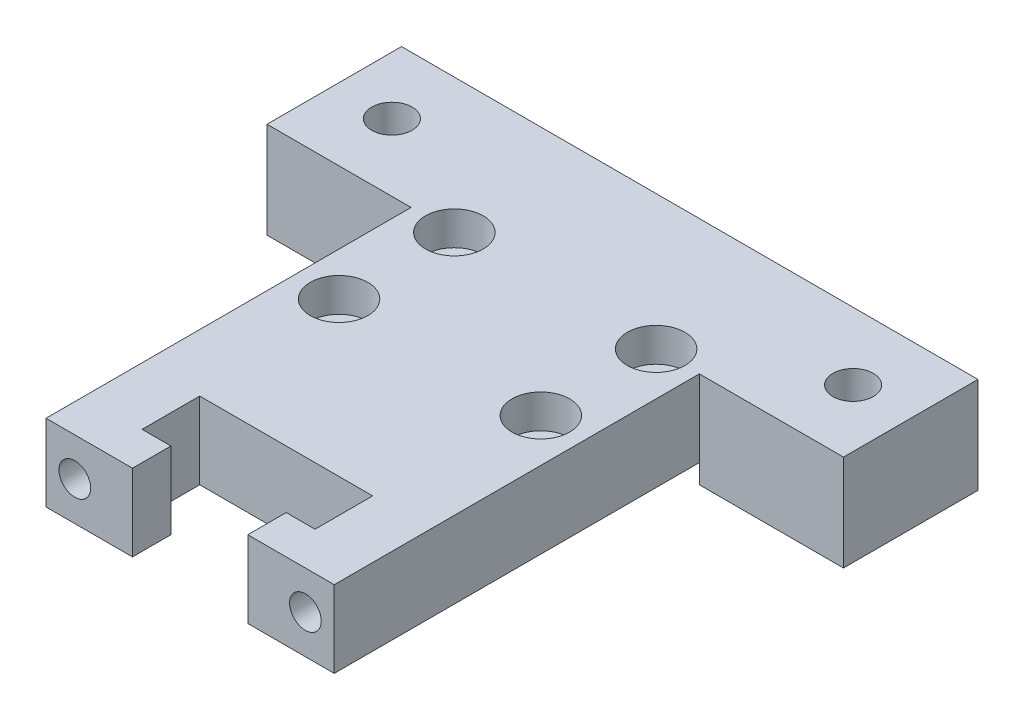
ISO-10303-21;
HEADER;
FILE_DESCRIPTION(('STEP AP214'),'2;1');
FILE_NAME('part.step','',(''),(''),'','','');
FILE_SCHEMA(('AUTOMOTIVE_DESIGN { 1 0 10303 214 1 1 1 1 }'));
ENDSEC;
DATA;
#1=APPLICATION_CONTEXT('core data for automotive mechanical design processes');
#2=APPLICATION_PROTOCOL_DEFINITION('international standard','automotive_design',2000,#1);
#3=PRODUCT_CONTEXT('',#1,'mechanical');
#4=PRODUCT('Part','Part','',(#3));
#5=PRODUCT_RELATED_PRODUCT_CATEGORY('part','',(#4));
#6=PRODUCT_DEFINITION_FORMATION('','',#4);
#7=PRODUCT_DEFINITION_CONTEXT('part definition',#1,'design');
#8=PRODUCT_DEFINITION('design','',#6,#7);
#9=PRODUCT_DEFINITION_SHAPE('','',#8);
#10=(LENGTH_UNIT() NAMED_UNIT(*) SI_UNIT(.MILLI.,.METRE.));
#11=(NAMED_UNIT(*) PLANE_ANGLE_UNIT() SI_UNIT($,.RADIAN.));
#12=(NAMED_UNIT(*) SI_UNIT($,.STERADIAN.) SOLID_ANGLE_UNIT());
#13=UNCERTAINTY_MEASURE_WITH_UNIT(LENGTH_MEASURE(1.E-05),#10,'distance_accuracy_value','');
#14=(GEOMETRIC_REPRESENTATION_CONTEXT(3) GLOBAL_UNCERTAINTY_ASSIGNED_CONTEXT((#13)) GLOBAL_UNIT_ASSIGNED_CONTEXT((#10,
#11,#12)) REPRESENTATION_CONTEXT('',''));
#15=CARTESIAN_POINT('',(0.,0.,0.));
#16=DIRECTION('',(0.,0.,1.));
#17=DIRECTION('',(1.,0.,0.));
#18=AXIS2_PLACEMENT_3D('',#15,#16,#17);
#19=CARTESIAN_POINT('',(12.,6.02822435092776,10.4999999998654));
#20=DIRECTION('',(0.,0.,1.));
#21=DIRECTION('',(1.,0.,0.));
#22=AXIS2_PLACEMENT_3D('',#19,#20,#21);
#23=CONICAL_SURFACE('',#22,1.64999999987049,1.02974425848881);
#24=CARTESIAN_POINT('',(11.9999999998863,6.02822435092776,9.50857997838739));
#25=VERTEX_POINT('',#24);
#26=VERTEX_LOOP('',#25);
#27=FACE_BOUND('',#26,.T.);
#28=CARTESIAN_POINT('',(12.,6.02822435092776,10.5));
#29=DIRECTION('',(0.,0.,1.));
#30=DIRECTION('',(1.,0.,0.));
#31=AXIS2_PLACEMENT_3D('',#28,#29,#30);
#32=CIRCLE('',#31,1.64999999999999);
#33=CARTESIAN_POINT('',(13.65,6.02822435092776,10.5));
#34=VERTEX_POINT('',#33);
#35=EDGE_CURVE('E156',#34,#34,#32,.T.);
#36=ORIENTED_EDGE('',*,*,#35,.T.);
#37=EDGE_LOOP('',(#36));
#38=FACE_BOUND('',#37,.T.);
#39=ADVANCED_FACE('F17',(#27,#38),#23,.F.);
#40=CARTESIAN_POINT('',(-12.,6.02822435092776,10.4999999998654));
#41=DIRECTION('',(0.,0.,1.));
#42=DIRECTION('',(1.,0.,0.));
#43=AXIS2_PLACEMENT_3D('',#40,#41,#42);
#44=CONICAL_SURFACE('',#43,1.64999999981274,1.02974425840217);
#45=CARTESIAN_POINT('',(-12.0000000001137,6.02822435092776,9.50857997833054));
#46=VERTEX_POINT('',#45);
#47=VERTEX_LOOP('',#46);
#48=FACE_BOUND('',#47,.T.);
#49=CARTESIAN_POINT('',(-12.,6.02822435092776,10.5));
#50=DIRECTION('',(0.,0.,1.));
#51=DIRECTION('',(1.,0.,0.));
#52=AXIS2_PLACEMENT_3D('',#49,#50,#51);
#53=CIRCLE('',#52,1.64999999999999);
#54=CARTESIAN_POINT('',(-10.35,6.02822435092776,10.5));
#55=VERTEX_POINT('',#54);
#56=EDGE_CURVE('E158',#55,#55,#53,.T.);
#57=ORIENTED_EDGE('',*,*,#56,.T.);
#58=EDGE_LOOP('',(#57));
#59=FACE_BOUND('',#58,.T.);
#60=ADVANCED_FACE('F153',(#48,#59),#44,.F.);
#61=CARTESIAN_POINT('',(-10.5,0.,0.));
#62=DIRECTION('',(0.,1.,0.));
#63=DIRECTION('',(0.,0.,1.));
#64=AXIS2_PLACEMENT_3D('',#61,#62,#63);
#65=CYLINDRICAL_SURFACE('',#64,1.75);
#66=CARTESIAN_POINT('',(-10.5,2.,0.));
#67=DIRECTION('',(0.,1.,0.));
#68=DIRECTION('',(0.,0.,1.));
#69=AXIS2_PLACEMENT_3D('',#66,#67,#68);
#70=CIRCLE('',#69,1.75);
#71=CARTESIAN_POINT('',(-10.5,2.,1.75));
#72=VERTEX_POINT('',#71);
#73=EDGE_CURVE('E20',#72,#72,#70,.T.);
#74=ORIENTED_EDGE('',*,*,#73,.F.);
#75=EDGE_LOOP('',(#74));
#76=FACE_BOUND('',#75,.T.);
#77=CARTESIAN_POINT('',(-10.5,6.5,0.));
#78=DIRECTION('',(0.,1.,0.));
#79=DIRECTION('',(0.,0.,1.));
#80=AXIS2_PLACEMENT_3D('',#77,#78,#79);
#81=CIRCLE('',#80,1.75);
#82=CARTESIAN_POINT('',(-10.5,6.5,1.75));
#83=VERTEX_POINT('',#82);
#84=EDGE_CURVE('E220',#83,#83,#81,.F.);
#85=ORIENTED_EDGE('',*,*,#84,.F.);
#86=EDGE_LOOP('',(#85));
#87=FACE_BOUND('',#86,.T.);
#88=ADVANCED_FACE('F536',(#76,#87),#65,.F.);
#89=CARTESIAN_POINT('',(10.5,0.,0.));
#90=DIRECTION('',(0.,1.,0.));
#91=DIRECTION('',(0.,0.,1.));
#92=AXIS2_PLACEMENT_3D('',#89,#90,#91);
#93=CYLINDRICAL_SURFACE('',#92,1.75);
#94=CARTESIAN_POINT('',(10.5,2.,0.));
#95=DIRECTION('',(0.,1.,0.));
#96=DIRECTION('',(0.,0.,1.));
#97=AXIS2_PLACEMENT_3D('',#94,#95,#96);
#98=CIRCLE('',#97,1.75);
#99=CARTESIAN_POINT('',(10.5,2.,1.75));
#100=VERTEX_POINT('',#99);
#101=EDGE_CURVE('E230',#100,#100,#98,.T.);
#102=ORIENTED_EDGE('',*,*,#101,.F.);
#103=EDGE_LOOP('',(#102));
#104=FACE_BOUND('',#103,.T.);
#105=CARTESIAN_POINT('',(10.5,6.5,0.));
#106=DIRECTION('',(0.,1.,0.));
#107=DIRECTION('',(0.,0.,1.));
#108=AXIS2_PLACEMENT_3D('',#105,#106,#107);
#109=CIRCLE('',#108,1.75);
#110=CARTESIAN_POINT('',(10.5,6.5,1.75));
#111=VERTEX_POINT('',#110);
#112=EDGE_CURVE('E217',#111,#111,#109,.F.);
#113=ORIENTED_EDGE('',*,*,#112,.F.);
#114=EDGE_LOOP('',(#113));
#115=FACE_BOUND('',#114,.T.);
#116=ADVANCED_FACE('F532',(#104,#115),#93,.F.);
#117=CARTESIAN_POINT('',(10.5,0.,-12.));
#118=DIRECTION('',(0.,1.,0.));
#119=DIRECTION('',(0.,0.,1.));
#120=AXIS2_PLACEMENT_3D('',#117,#118,#119);
#121=CYLINDRICAL_SURFACE('',#120,1.75);
#122=CARTESIAN_POINT('',(10.5,2.,-12.));
#123=DIRECTION('',(0.,1.,0.));
#124=DIRECTION('',(0.,0.,1.));
#125=AXIS2_PLACEMENT_3D('',#122,#123,#124);
#126=CIRCLE('',#125,1.75);
#127=CARTESIAN_POINT('',(10.5,2.,-10.25));
#128=VERTEX_POINT('',#127);
#129=EDGE_CURVE('E228',#128,#128,#126,.T.);
#130=ORIENTED_EDGE('',*,*,#129,.F.);
#131=EDGE_LOOP('',(#130));
#132=FACE_BOUND('',#131,.T.);
#133=CARTESIAN_POINT('',(10.5,6.5,-12.));
#134=DIRECTION('',(0.,1.,0.));
#135=DIRECTION('',(0.,0.,1.));
#136=AXIS2_PLACEMENT_3D('',#133,#134,#135);
#137=CIRCLE('',#136,1.75);
#138=CARTESIAN_POINT('',(10.5,6.5,-10.25));
#139=VERTEX_POINT('',#138);
#140=EDGE_CURVE('E214',#139,#139,#137,.F.);
#141=ORIENTED_EDGE('',*,*,#140,.F.);
#142=EDGE_LOOP('',(#141));
#143=FACE_BOUND('',#142,.T.);
#144=ADVANCED_FACE('F528',(#132,#143),#121,.F.);
#145=CARTESIAN_POINT('',(-10.5,0.,-12.));
#146=DIRECTION('',(0.,1.,0.));
#147=DIRECTION('',(0.,0.,1.));
#148=AXIS2_PLACEMENT_3D('',#145,#146,#147);
#149=CYLINDRICAL_SURFACE('',#148,1.75);
#150=CARTESIAN_POINT('',(-10.5,2.,-12.));
#151=DIRECTION('',(0.,1.,0.));
#152=DIRECTION('',(0.,0.,1.));
#153=AXIS2_PLACEMENT_3D('',#150,#151,#152);
#154=CIRCLE('',#153,1.75);
#155=CARTESIAN_POINT('',(-10.5,2.,-10.25));
#156=VERTEX_POINT('',#155);
#157=EDGE_CURVE('E224',#156,#156,#154,.T.);
#158=ORIENTED_EDGE('',*,*,#157,.F.);
#159=EDGE_LOOP('',(#158));
#160=FACE_BOUND('',#159,.T.);
#161=CARTESIAN_POINT('',(-10.5,6.5,-12.));
#162=DIRECTION('',(0.,1.,0.));
#163=DIRECTION('',(0.,0.,1.));
#164=AXIS2_PLACEMENT_3D('',#161,#162,#163);
#165=CIRCLE('',#164,1.75);
#166=CARTESIAN_POINT('',(-10.5,6.5,-10.25));
#167=VERTEX_POINT('',#166);
#168=EDGE_CURVE('E210',#167,#167,#165,.F.);
#169=ORIENTED_EDGE('',*,*,#168,.F.);
#170=EDGE_LOOP('',(#169));
#171=FACE_BOUND('',#170,.T.);
#172=ADVANCED_FACE('F525',(#160,#171),#149,.F.);
#173=CARTESIAN_POINT('',(12.,6.02822435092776,26.));
#174=DIRECTION('',(0.,0.,1.));
#175=DIRECTION('',(1.,0.,0.));
#176=AXIS2_PLACEMENT_3D('',#173,#174,#175);
#177=CYLINDRICAL_SURFACE('',#176,1.64999999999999);
#178=ORIENTED_EDGE('',*,*,#35,.F.);
#179=EDGE_LOOP('',(#178));
#180=FACE_BOUND('',#179,.T.);
#181=CARTESIAN_POINT('',(12.,6.02822435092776,26.));
#182=DIRECTION('',(0.,0.,1.));
#183=DIRECTION('',(1.,0.,0.));
#184=AXIS2_PLACEMENT_3D('',#181,#182,#183);
#185=CIRCLE('',#184,1.64999999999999);
#186=CARTESIAN_POINT('',(13.65,6.02822435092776,26.));
#187=VERTEX_POINT('',#186);
#188=EDGE_CURVE('E205',#187,#187,#185,.T.);
#189=ORIENTED_EDGE('',*,*,#188,.T.);
#190=EDGE_LOOP('',(#189));
#191=FACE_BOUND('',#190,.T.);
#192=ADVANCED_FACE('F521',(#180,#191),#177,.F.);
#193=CARTESIAN_POINT('',(15.,2.,26.));
#194=DIRECTION('',(1.,0.,0.));
#195=DIRECTION('',(0.,0.,-1.));
#196=AXIS2_PLACEMENT_3D('',#193,#194,#195);
#197=PLANE('',#196);
#198=DIRECTION('',(0.,1.,0.));
#199=VECTOR('',#198,1.);
#200=CARTESIAN_POINT('',(15.,10.,-12.));
#201=LINE('',#200,#199);
#202=CARTESIAN_POINT('',(15.,0.,-12.));
#203=VERTEX_POINT('',#202);
#204=CARTESIAN_POINT('',(15.,2.,-12.));
#205=VERTEX_POINT('',#204);
#206=EDGE_CURVE('E258',#203,#205,#201,.T.);
#207=ORIENTED_EDGE('',*,*,#206,.T.);
#208=DIRECTION('',(0.,0.,-1.));
#209=VECTOR('',#208,1.);
#210=CARTESIAN_POINT('',(15.,2.,0.));
#211=LINE('',#210,#209);
#212=CARTESIAN_POINT('',(15.,2.,-26.));
#213=VERTEX_POINT('',#212);
#214=EDGE_CURVE('E235',#213,#205,#211,.F.);
#215=ORIENTED_EDGE('',*,*,#214,.F.);
#216=DIRECTION('',(0.,1.,0.));
#217=VECTOR('',#216,1.);
#218=CARTESIAN_POINT('',(15.,10.,-26.));
#219=LINE('',#218,#217);
#220=CARTESIAN_POINT('',(15.,0.,-26.));
#221=VERTEX_POINT('',#220);
#222=EDGE_CURVE('E278',#213,#221,#219,.F.);
#223=ORIENTED_EDGE('',*,*,#222,.T.);
#224=DIRECTION('',(0.,0.,1.));
#225=VECTOR('',#224,1.);
#226=CARTESIAN_POINT('',(15.,0.,0.));
#227=LINE('',#226,#225);
#228=EDGE_CURVE('E223',#221,#203,#227,.T.);
#229=ORIENTED_EDGE('',*,*,#228,.T.);
#230=EDGE_LOOP('',(#207,#215,#223,#229));
#231=FACE_BOUND('',#230,.T.);
#232=ADVANCED_FACE('F517',(#231),#197,.F.);
#233=CARTESIAN_POINT('',(-15.,2.,26.));
#234=DIRECTION('',(-1.,0.,0.));
#235=DIRECTION('',(0.,0.,1.));
#236=AXIS2_PLACEMENT_3D('',#233,#234,#235);
#237=PLANE('',#236);
#238=DIRECTION('',(0.,1.,0.));
#239=VECTOR('',#238,1.);
#240=CARTESIAN_POINT('',(-15.,10.,-12.));
#241=LINE('',#240,#239);
#242=CARTESIAN_POINT('',(-15.,2.,-12.));
#243=VERTEX_POINT('',#242);
#244=CARTESIAN_POINT('',(-15.,0.,-12.));
#245=VERTEX_POINT('',#244);
#246=EDGE_CURVE('E290',#243,#245,#241,.F.);
#247=ORIENTED_EDGE('',*,*,#246,.T.);
#248=DIRECTION('',(0.,0.,1.));
#249=VECTOR('',#248,1.);
#250=CARTESIAN_POINT('',(-15.,0.,0.));
#251=LINE('',#250,#249);
#252=CARTESIAN_POINT('',(-15.,0.,-26.));
#253=VERTEX_POINT('',#252);
#254=EDGE_CURVE('E227',#245,#253,#251,.F.);
#255=ORIENTED_EDGE('',*,*,#254,.T.);
#256=DIRECTION('',(0.,1.,0.));
#257=VECTOR('',#256,1.);
#258=CARTESIAN_POINT('',(-15.,10.,-26.));
#259=LINE('',#258,#257);
#260=CARTESIAN_POINT('',(-15.,2.,-26.));
#261=VERTEX_POINT('',#260);
#262=EDGE_CURVE('E274',#253,#261,#259,.T.);
#263=ORIENTED_EDGE('',*,*,#262,.T.);
#264=DIRECTION('',(0.,0.,-1.));
#265=VECTOR('',#264,1.);
#266=CARTESIAN_POINT('',(-15.,2.,0.));
#267=LINE('',#266,#265);
#268=EDGE_CURVE('E161',#243,#261,#267,.T.);
#269=ORIENTED_EDGE('',*,*,#268,.F.);
#270=EDGE_LOOP('',(#247,#255,#263,#269));
#271=FACE_BOUND('',#270,.T.);
#272=ADVANCED_FACE('F513',(#271),#237,.F.);
#273=CARTESIAN_POINT('',(-12.,6.02822435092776,26.));
#274=DIRECTION('',(0.,0.,1.));
#275=DIRECTION('',(1.,0.,0.));
#276=AXIS2_PLACEMENT_3D('',#273,#274,#275);
#277=CYLINDRICAL_SURFACE('',#276,1.64999999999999);
#278=ORIENTED_EDGE('',*,*,#56,.F.);
#279=EDGE_LOOP('',(#278));
#280=FACE_BOUND('',#279,.T.);
#281=CARTESIAN_POINT('',(-12.,6.02822435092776,26.));
#282=DIRECTION('',(0.,0.,1.));
#283=DIRECTION('',(1.,0.,0.));
#284=AXIS2_PLACEMENT_3D('',#281,#282,#283);
#285=CIRCLE('',#284,1.64999999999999);
#286=CARTESIAN_POINT('',(-10.35,6.02822435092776,26.));
#287=VERTEX_POINT('',#286);
#288=EDGE_CURVE('E200',#287,#287,#285,.T.);
#289=ORIENTED_EDGE('',*,*,#288,.T.);
#290=EDGE_LOOP('',(#289));
#291=FACE_BOUND('',#290,.T.);
#292=ADVANCED_FACE('F506',(#280,#291),#277,.F.);
#293=CARTESIAN_POINT('',(0.,2.,0.));
#294=DIRECTION('',(0.,-1.,0.));
#295=DIRECTION('',(0.,0.,-1.));
#296=AXIS2_PLACEMENT_3D('',#293,#294,#295);
#297=PLANE('',#296);
#298=ORIENTED_EDGE('',*,*,#157,.T.);
#299=EDGE_LOOP('',(#298));
#300=FACE_BOUND('',#299,.T.);
#301=ORIENTED_EDGE('',*,*,#129,.T.);
#302=EDGE_LOOP('',(#301));
#303=FACE_BOUND('',#302,.T.);
#304=ORIENTED_EDGE('',*,*,#101,.T.);
#305=EDGE_LOOP('',(#304));
#306=FACE_BOUND('',#305,.T.);
#307=ORIENTED_EDGE('',*,*,#73,.T.);
#308=EDGE_LOOP('',(#307));
#309=FACE_BOUND('',#308,.T.);
#310=DIRECTION('',(-1.,0.,0.));
#311=VECTOR('',#310,1.);
#312=CARTESIAN_POINT('',(-6.00000000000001,2.,16.));
#313=LINE('',#312,#311);
#314=CARTESIAN_POINT('',(8.99999999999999,2.,16.));
#315=VERTEX_POINT('',#314);
#316=CARTESIAN_POINT('',(-9.00000000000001,2.,16.));
#317=VERTEX_POINT('',#316);
#318=EDGE_CURVE('E320',#315,#317,#313,.T.);
#319=ORIENTED_EDGE('',*,*,#318,.T.);
#320=DIRECTION('',(0.,0.,1.));
#321=VECTOR('',#320,1.);
#322=CARTESIAN_POINT('',(-9.00000000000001,2.,16.));
#323=LINE('',#322,#321);
#324=CARTESIAN_POINT('',(-9.00000000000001,2.,22.));
#325=VERTEX_POINT('',#324);
#326=EDGE_CURVE('E315',#317,#325,#323,.T.);
#327=ORIENTED_EDGE('',*,*,#326,.T.);
#328=DIRECTION('',(1.,0.,0.));
#329=VECTOR('',#328,1.);
#330=CARTESIAN_POINT('',(-9.00000000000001,2.,22.));
#331=LINE('',#330,#329);
#332=CARTESIAN_POINT('',(-6.00000000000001,2.,22.));
#333=VERTEX_POINT('',#332);
#334=EDGE_CURVE('E310',#325,#333,#331,.T.);
#335=ORIENTED_EDGE('',*,*,#334,.T.);
#336=DIRECTION('',(0.,0.,1.));
#337=VECTOR('',#336,1.);
#338=CARTESIAN_POINT('',(-6.00000000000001,2.,36.));
#339=LINE('',#338,#337);
#340=CARTESIAN_POINT('',(-6.00000000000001,2.,26.));
#341=VERTEX_POINT('',#340);
#342=EDGE_CURVE('E305',#333,#341,#339,.T.);
#343=ORIENTED_EDGE('',*,*,#342,.T.);
#344=DIRECTION('',(-1.,0.,0.));
#345=VECTOR('',#344,1.);
#346=CARTESIAN_POINT('',(-30.,2.,26.));
#347=LINE('',#346,#345);
#348=CARTESIAN_POINT('',(-15.,2.,26.));
#349=VERTEX_POINT('',#348);
#350=EDGE_CURVE('E300',#341,#349,#347,.T.);
#351=ORIENTED_EDGE('',*,*,#350,.T.);
#352=DIRECTION('',(0.,0.,-1.));
#353=VECTOR('',#352,1.);
#354=CARTESIAN_POINT('',(-15.,2.,26.));
#355=LINE('',#354,#353);
#356=EDGE_CURVE('E204',#349,#243,#355,.T.);
#357=ORIENTED_EDGE('',*,*,#356,.T.);
#358=ORIENTED_EDGE('',*,*,#268,.T.);
#359=DIRECTION('',(1.,0.,0.));
#360=VECTOR('',#359,1.);
#361=CARTESIAN_POINT('',(-30.,2.,-26.));
#362=LINE('',#361,#360);
#363=EDGE_CURVE('E276',#261,#213,#362,.T.);
#364=ORIENTED_EDGE('',*,*,#363,.T.);
#365=ORIENTED_EDGE('',*,*,#214,.T.);
#366=DIRECTION('',(0.,0.,1.));
#367=VECTOR('',#366,1.);
#368=CARTESIAN_POINT('',(15.,2.,26.));
#369=LINE('',#368,#367);
#370=CARTESIAN_POINT('',(15.,2.,26.));
#371=VERTEX_POINT('',#370);
#372=EDGE_CURVE('E256',#205,#371,#369,.T.);
#373=ORIENTED_EDGE('',*,*,#372,.T.);
#374=DIRECTION('',(-1.,0.,0.));
#375=VECTOR('',#374,1.);
#376=CARTESIAN_POINT('',(-30.,2.,26.));
#377=LINE('',#376,#375);
#378=CARTESIAN_POINT('',(5.99999999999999,2.,26.));
#379=VERTEX_POINT('',#378);
#380=EDGE_CURVE('E208',#371,#379,#377,.T.);
#381=ORIENTED_EDGE('',*,*,#380,.T.);
#382=DIRECTION('',(0.,0.,-1.));
#383=VECTOR('',#382,1.);
#384=CARTESIAN_POINT('',(5.99999999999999,2.,36.));
#385=LINE('',#384,#383);
#386=CARTESIAN_POINT('',(5.99999999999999,2.,22.));
#387=VERTEX_POINT('',#386);
#388=EDGE_CURVE('E248',#379,#387,#385,.T.);
#389=ORIENTED_EDGE('',*,*,#388,.T.);
#390=DIRECTION('',(1.,0.,0.));
#391=VECTOR('',#390,1.);
#392=CARTESIAN_POINT('',(-9.00000000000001,2.,22.));
#393=LINE('',#392,#391);
#394=CARTESIAN_POINT('',(8.99999999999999,2.,22.));
#395=VERTEX_POINT('',#394);
#396=EDGE_CURVE('E213',#387,#395,#393,.T.);
#397=ORIENTED_EDGE('',*,*,#396,.T.);
#398=DIRECTION('',(0.,0.,-1.));
#399=VECTOR('',#398,1.);
#400=CARTESIAN_POINT('',(8.99999999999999,2.,22.));
#401=LINE('',#400,#399);
#402=EDGE_CURVE('E199',#395,#315,#401,.T.);
#403=ORIENTED_EDGE('',*,*,#402,.T.);
#404=EDGE_LOOP('',(#319,#327,#335,#343,#351,#357,#358,#364,#365,#373,#381,#389,#397,#403));
#405=FACE_BOUND('',#404,.T.);
#406=ADVANCED_FACE('F496',(#300,#303,#306,#309,#405),#297,.T.);
#407=CARTESIAN_POINT('',(0.,0.,0.));
#408=DIRECTION('',(0.,1.,0.));
#409=DIRECTION('',(0.,0.,1.));
#410=AXIS2_PLACEMENT_3D('',#407,#408,#409);
#411=PLANE('',#410);
#412=DIRECTION('',(-1.,0.,0.));
#413=VECTOR('',#412,1.);
#414=CARTESIAN_POINT('',(-30.,0.,-12.));
#415=LINE('',#414,#413);
#416=CARTESIAN_POINT('',(-30.,0.,-12.));
#417=VERTEX_POINT('',#416);
#418=EDGE_CURVE('E292',#245,#417,#415,.T.);
#419=ORIENTED_EDGE('',*,*,#418,.T.);
#420=DIRECTION('',(0.,0.,-1.));
#421=VECTOR('',#420,1.);
#422=CARTESIAN_POINT('',(-30.,0.,-26.));
#423=LINE('',#422,#421);
#424=CARTESIAN_POINT('',(-30.,0.,-26.));
#425=VERTEX_POINT('',#424);
#426=EDGE_CURVE('E285',#417,#425,#423,.T.);
#427=ORIENTED_EDGE('',*,*,#426,.T.);
#428=DIRECTION('',(1.,0.,0.));
#429=VECTOR('',#428,1.);
#430=CARTESIAN_POINT('',(-30.,0.,-26.));
#431=LINE('',#430,#429);
#432=EDGE_CURVE('E271',#425,#253,#431,.T.);
#433=ORIENTED_EDGE('',*,*,#432,.T.);
#434=ORIENTED_EDGE('',*,*,#254,.F.);
#435=EDGE_LOOP('',(#419,#427,#433,#434));
#436=FACE_BOUND('',#435,.T.);
#437=CARTESIAN_POINT('',(-24.,0.,-19.));
#438=DIRECTION('',(0.,1.,0.));
#439=DIRECTION('',(0.,0.,1.));
#440=AXIS2_PLACEMENT_3D('',#437,#438,#439);
#441=CIRCLE('',#440,2.09999999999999);
#442=CARTESIAN_POINT('',(-24.,0.,-16.9));
#443=VERTEX_POINT('',#442);
#444=EDGE_CURVE('E196',#443,#443,#441,.T.);
#445=ORIENTED_EDGE('',*,*,#444,.T.);
#446=EDGE_LOOP('',(#445));
#447=FACE_BOUND('',#446,.T.);
#448=ADVANCED_FACE('F493',(#436,#447),#411,.F.);
#449=CARTESIAN_POINT('',(0.,0.,0.));
#450=DIRECTION('',(0.,1.,0.));
#451=DIRECTION('',(0.,0.,1.));
#452=AXIS2_PLACEMENT_3D('',#449,#450,#451);
#453=PLANE('',#452);
#454=DIRECTION('',(-1.,0.,0.));
#455=VECTOR('',#454,1.);
#456=CARTESIAN_POINT('',(30.,0.,-12.));
#457=LINE('',#456,#455);
#458=CARTESIAN_POINT('',(30.,0.,-12.));
#459=VERTEX_POINT('',#458);
#460=EDGE_CURVE('E262',#459,#203,#457,.T.);
#461=ORIENTED_EDGE('',*,*,#460,.T.);
#462=ORIENTED_EDGE('',*,*,#228,.F.);
#463=DIRECTION('',(1.,0.,0.));
#464=VECTOR('',#463,1.);
#465=CARTESIAN_POINT('',(-30.,0.,-26.));
#466=LINE('',#465,#464);
#467=CARTESIAN_POINT('',(30.,0.,-26.));
#468=VERTEX_POINT('',#467);
#469=EDGE_CURVE('E280',#221,#468,#466,.T.);
#470=ORIENTED_EDGE('',*,*,#469,.T.);
#471=DIRECTION('',(0.,0.,1.));
#472=VECTOR('',#471,1.);
#473=CARTESIAN_POINT('',(30.,0.,-26.));
#474=LINE('',#473,#472);
#475=EDGE_CURVE('E265',#468,#459,#474,.T.);
#476=ORIENTED_EDGE('',*,*,#475,.T.);
#477=EDGE_LOOP('',(#461,#462,#470,#476));
#478=FACE_BOUND('',#477,.T.);
#479=CARTESIAN_POINT('',(24.,0.,-19.));
#480=DIRECTION('',(0.,1.,0.));
#481=DIRECTION('',(0.,0.,1.));
#482=AXIS2_PLACEMENT_3D('',#479,#480,#481);
#483=CIRCLE('',#482,2.09999999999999);
#484=CARTESIAN_POINT('',(24.,0.,-16.9));
#485=VERTEX_POINT('',#484);
#486=EDGE_CURVE('E193',#485,#485,#483,.T.);
#487=ORIENTED_EDGE('',*,*,#486,.T.);
#488=EDGE_LOOP('',(#487));
#489=FACE_BOUND('',#488,.T.);
#490=ADVANCED_FACE('F495',(#478,#489),#453,.F.);
#491=CARTESIAN_POINT('',(-10.5,6.5,0.));
#492=DIRECTION('',(0.,1.,0.));
#493=DIRECTION('',(0.,0.,1.));
#494=AXIS2_PLACEMENT_3D('',#491,#492,#493);
#495=PLANE('',#494);
#496=ORIENTED_EDGE('',*,*,#84,.T.);
#497=EDGE_LOOP('',(#496));
#498=FACE_BOUND('',#497,.T.);
#499=CARTESIAN_POINT('',(-10.5,6.5,0.));
#500=DIRECTION('',(0.,1.,0.));
#501=DIRECTION('',(0.,0.,1.));
#502=AXIS2_PLACEMENT_3D('',#499,#500,#501);
#503=CIRCLE('',#502,3.);
#504=CARTESIAN_POINT('',(-10.5,6.5,3.));
#505=VERTEX_POINT('',#504);
#506=EDGE_CURVE('E190',#505,#505,#503,.T.);
#507=ORIENTED_EDGE('',*,*,#506,.T.);
#508=EDGE_LOOP('',(#507));
#509=FACE_BOUND('',#508,.T.);
#510=ADVANCED_FACE('F503',(#498,#509),#495,.T.);
#511=CARTESIAN_POINT('',(10.5,6.5,0.));
#512=DIRECTION('',(0.,1.,0.));
#513=DIRECTION('',(0.,0.,1.));
#514=AXIS2_PLACEMENT_3D('',#511,#512,#513);
#515=PLANE('',#514);
#516=ORIENTED_EDGE('',*,*,#112,.T.);
#517=EDGE_LOOP('',(#516));
#518=FACE_BOUND('',#517,.T.);
#519=CARTESIAN_POINT('',(10.5,6.5,0.));
#520=DIRECTION('',(0.,1.,0.));
#521=DIRECTION('',(0.,0.,1.));
#522=AXIS2_PLACEMENT_3D('',#519,#520,#521);
#523=CIRCLE('',#522,3.);
#524=CARTESIAN_POINT('',(10.5,6.5,3.));
#525=VERTEX_POINT('',#524);
#526=EDGE_CURVE('E187',#525,#525,#523,.T.);
#527=ORIENTED_EDGE('',*,*,#526,.T.);
#528=EDGE_LOOP('',(#527));
#529=FACE_BOUND('',#528,.T.);
#530=ADVANCED_FACE('F582',(#518,#529),#515,.T.);
#531=CARTESIAN_POINT('',(10.5,6.5,-12.));
#532=DIRECTION('',(0.,1.,0.));
#533=DIRECTION('',(0.,0.,1.));
#534=AXIS2_PLACEMENT_3D('',#531,#532,#533);
#535=PLANE('',#534);
#536=ORIENTED_EDGE('',*,*,#140,.T.);
#537=EDGE_LOOP('',(#536));
#538=FACE_BOUND('',#537,.T.);
#539=CARTESIAN_POINT('',(10.5,6.5,-12.));
#540=DIRECTION('',(0.,1.,0.));
#541=DIRECTION('',(0.,0.,1.));
#542=AXIS2_PLACEMENT_3D('',#539,#540,#541);
#543=CIRCLE('',#542,3.);
#544=CARTESIAN_POINT('',(10.5,6.5,-9.));
#545=VERTEX_POINT('',#544);
#546=EDGE_CURVE('E184',#545,#545,#543,.T.);
#547=ORIENTED_EDGE('',*,*,#546,.T.);
#548=EDGE_LOOP('',(#547));
#549=FACE_BOUND('',#548,.T.);
#550=ADVANCED_FACE('F578',(#538,#549),#535,.T.);
#551=CARTESIAN_POINT('',(-10.5,6.5,-12.));
#552=DIRECTION('',(0.,1.,0.));
#553=DIRECTION('',(0.,0.,1.));
#554=AXIS2_PLACEMENT_3D('',#551,#552,#553);
#555=PLANE('',#554);
#556=ORIENTED_EDGE('',*,*,#168,.T.);
#557=EDGE_LOOP('',(#556));
#558=FACE_BOUND('',#557,.T.);
#559=CARTESIAN_POINT('',(-10.5,6.5,-12.));
#560=DIRECTION('',(0.,1.,0.));
#561=DIRECTION('',(0.,0.,1.));
#562=AXIS2_PLACEMENT_3D('',#559,#560,#561);
#563=CIRCLE('',#562,3.);
#564=CARTESIAN_POINT('',(-10.5,6.5,-9.));
#565=VERTEX_POINT('',#564);
#566=EDGE_CURVE('E180',#565,#565,#563,.T.);
#567=ORIENTED_EDGE('',*,*,#566,.T.);
#568=EDGE_LOOP('',(#567));
#569=FACE_BOUND('',#568,.T.);
#570=ADVANCED_FACE('F575',(#558,#569),#555,.T.);
#571=CARTESIAN_POINT('',(-9.00000000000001,0.,22.));
#572=DIRECTION('',(0.,0.,1.));
#573=DIRECTION('',(1.,0.,0.));
#574=AXIS2_PLACEMENT_3D('',#571,#572,#573);
#575=PLANE('',#574);
#576=DIRECTION('',(0.,1.,0.));
#577=VECTOR('',#576,1.);
#578=CARTESIAN_POINT('',(5.99999999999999,0.,22.));
#579=LINE('',#578,#577);
#580=CARTESIAN_POINT('',(5.99999999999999,10.,22.));
#581=VERTEX_POINT('',#580);
#582=EDGE_CURVE('E209',#387,#581,#579,.T.);
#583=ORIENTED_EDGE('',*,*,#582,.T.);
#584=DIRECTION('',(1.,0.,0.));
#585=VECTOR('',#584,1.);
#586=CARTESIAN_POINT('',(0.,10.,22.));
#587=LINE('',#586,#585);
#588=CARTESIAN_POINT('',(8.99999999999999,10.,22.));
#589=VERTEX_POINT('',#588);
#590=EDGE_CURVE('E183',#589,#581,#587,.F.);
#591=ORIENTED_EDGE('',*,*,#590,.F.);
#592=DIRECTION('',(0.,1.,0.));
#593=VECTOR('',#592,1.);
#594=CARTESIAN_POINT('',(8.99999999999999,0.,22.));
#595=LINE('',#594,#593);
#596=EDGE_CURVE('E324',#589,#395,#595,.F.);
#597=ORIENTED_EDGE('',*,*,#596,.T.);
#598=ORIENTED_EDGE('',*,*,#396,.F.);
#599=EDGE_LOOP('',(#583,#591,#597,#598));
#600=FACE_BOUND('',#599,.T.);
#601=ADVANCED_FACE('F382',(#600),#575,.F.);
#602=CARTESIAN_POINT('',(5.99999999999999,0.,36.));
#603=DIRECTION('',(1.,0.,0.));
#604=DIRECTION('',(0.,0.,-1.));
#605=AXIS2_PLACEMENT_3D('',#602,#603,#604);
#606=PLANE('',#605);
#607=ORIENTED_EDGE('',*,*,#582,.F.);
#608=ORIENTED_EDGE('',*,*,#388,.F.);
#609=DIRECTION('',(0.,1.,0.));
#610=VECTOR('',#609,1.);
#611=CARTESIAN_POINT('',(5.99999999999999,10.,26.));
#612=LINE('',#611,#610);
#613=CARTESIAN_POINT('',(5.99999999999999,10.,26.));
#614=VERTEX_POINT('',#613);
#615=EDGE_CURVE('E252',#379,#614,#612,.T.);
#616=ORIENTED_EDGE('',*,*,#615,.T.);
#617=DIRECTION('',(0.,0.,1.));
#618=VECTOR('',#617,1.);
#619=CARTESIAN_POINT('',(5.99999999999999,10.,0.));
#620=LINE('',#619,#618);
#621=EDGE_CURVE('E331',#581,#614,#620,.T.);
#622=ORIENTED_EDGE('',*,*,#621,.F.);
#623=EDGE_LOOP('',(#607,#608,#616,#622));
#624=FACE_BOUND('',#623,.T.);
#625=ADVANCED_FACE('F387',(#624),#606,.F.);
#626=CARTESIAN_POINT('',(-30.,10.,26.));
#627=DIRECTION('',(0.,0.,-1.));
#628=DIRECTION('',(-1.,0.,0.));
#629=AXIS2_PLACEMENT_3D('',#626,#627,#628);
#630=PLANE('',#629);
#631=ORIENTED_EDGE('',*,*,#615,.F.);
#632=ORIENTED_EDGE('',*,*,#380,.F.);
#633=DIRECTION('',(0.,1.,0.));
#634=VECTOR('',#633,1.);
#635=CARTESIAN_POINT('',(15.,10.,26.));
#636=LINE('',#635,#634);
#637=CARTESIAN_POINT('',(15.,10.,26.));
#638=VERTEX_POINT('',#637);
#639=EDGE_CURVE('E254',#371,#638,#636,.T.);
#640=ORIENTED_EDGE('',*,*,#639,.T.);
#641=DIRECTION('',(1.,0.,0.));
#642=VECTOR('',#641,1.);
#643=CARTESIAN_POINT('',(0.,10.,26.));
#644=LINE('',#643,#642);
#645=EDGE_CURVE('E334',#614,#638,#644,.T.);
#646=ORIENTED_EDGE('',*,*,#645,.F.);
#647=EDGE_LOOP('',(#631,#632,#640,#646));
#648=FACE_BOUND('',#647,.T.);
#649=ORIENTED_EDGE('',*,*,#188,.F.);
#650=EDGE_LOOP('',(#649));
#651=FACE_BOUND('',#650,.T.);
#652=ADVANCED_FACE('F392',(#648,#651),#630,.F.);
#653=CARTESIAN_POINT('',(15.,10.,26.));
#654=DIRECTION('',(-1.,0.,0.));
#655=DIRECTION('',(0.,0.,1.));
#656=AXIS2_PLACEMENT_3D('',#653,#654,#655);
#657=PLANE('',#656);
#658=DIRECTION('',(0.,1.,0.));
#659=VECTOR('',#658,1.);
#660=CARTESIAN_POINT('',(15.,10.,-12.));
#661=LINE('',#660,#659);
#662=CARTESIAN_POINT('',(15.,10.,-12.));
#663=VERTEX_POINT('',#662);
#664=EDGE_CURVE('E260',#205,#663,#661,.T.);
#665=ORIENTED_EDGE('',*,*,#664,.T.);
#666=DIRECTION('',(0.,0.,1.));
#667=VECTOR('',#666,1.);
#668=CARTESIAN_POINT('',(15.,10.,0.));
#669=LINE('',#668,#667);
#670=EDGE_CURVE('E337',#638,#663,#669,.F.);
#671=ORIENTED_EDGE('',*,*,#670,.F.);
#672=ORIENTED_EDGE('',*,*,#639,.F.);
#673=ORIENTED_EDGE('',*,*,#372,.F.);
#674=EDGE_LOOP('',(#665,#671,#672,#673));
#675=FACE_BOUND('',#674,.T.);
#676=ADVANCED_FACE('F397',(#675),#657,.F.);
#677=CARTESIAN_POINT('',(30.,10.,-12.));
#678=DIRECTION('',(0.,0.,-1.));
#679=DIRECTION('',(-1.,0.,0.));
#680=AXIS2_PLACEMENT_3D('',#677,#678,#679);
#681=PLANE('',#680);
#682=DIRECTION('',(0.,1.,0.));
#683=VECTOR('',#682,1.);
#684=CARTESIAN_POINT('',(30.,10.,-12.));
#685=LINE('',#684,#683);
#686=CARTESIAN_POINT('',(30.,10.,-12.));
#687=VERTEX_POINT('',#686);
#688=EDGE_CURVE('E267',#459,#687,#685,.T.);
#689=ORIENTED_EDGE('',*,*,#688,.T.);
#690=DIRECTION('',(1.,0.,0.));
#691=VECTOR('',#690,1.);
#692=CARTESIAN_POINT('',(0.,10.,-12.));
#693=LINE('',#692,#691);
#694=EDGE_CURVE('E340',#663,#687,#693,.T.);
#695=ORIENTED_EDGE('',*,*,#694,.F.);
#696=ORIENTED_EDGE('',*,*,#664,.F.);
#697=ORIENTED_EDGE('',*,*,#206,.F.);
#698=ORIENTED_EDGE('',*,*,#460,.F.);
#699=EDGE_LOOP('',(#689,#695,#696,#697,#698));
#700=FACE_BOUND('',#699,.T.);
#701=ADVANCED_FACE('F402',(#700),#681,.F.);
#702=CARTESIAN_POINT('',(30.,10.,-26.));
#703=DIRECTION('',(-1.,0.,0.));
#704=DIRECTION('',(0.,0.,1.));
#705=AXIS2_PLACEMENT_3D('',#702,#703,#704);
#706=PLANE('',#705);
#707=ORIENTED_EDGE('',*,*,#688,.F.);
#708=ORIENTED_EDGE('',*,*,#475,.F.);
#709=DIRECTION('',(0.,1.,0.));
#710=VECTOR('',#709,1.);
#711=CARTESIAN_POINT('',(30.,10.,-26.));
#712=LINE('',#711,#710);
#713=CARTESIAN_POINT('',(30.,10.,-26.));
#714=VERTEX_POINT('',#713);
#715=EDGE_CURVE('E269',#468,#714,#712,.T.);
#716=ORIENTED_EDGE('',*,*,#715,.T.);
#717=DIRECTION('',(0.,0.,1.));
#718=VECTOR('',#717,1.);
#719=CARTESIAN_POINT('',(30.,10.,0.));
#720=LINE('',#719,#718);
#721=EDGE_CURVE('E343',#687,#714,#720,.F.);
#722=ORIENTED_EDGE('',*,*,#721,.F.);
#723=EDGE_LOOP('',(#707,#708,#716,#722));
#724=FACE_BOUND('',#723,.T.);
#725=ADVANCED_FACE('F408',(#724),#706,.F.);
#726=CARTESIAN_POINT('',(-30.,10.,-26.));
#727=DIRECTION('',(0.,0.,1.));
#728=DIRECTION('',(1.,0.,0.));
#729=AXIS2_PLACEMENT_3D('',#726,#727,#728);
#730=PLANE('',#729);
#731=ORIENTED_EDGE('',*,*,#222,.F.);
#732=ORIENTED_EDGE('',*,*,#363,.F.);
#733=ORIENTED_EDGE('',*,*,#262,.F.);
#734=ORIENTED_EDGE('',*,*,#432,.F.);
#735=DIRECTION('',(0.,1.,0.));
#736=VECTOR('',#735,1.);
#737=CARTESIAN_POINT('',(-30.,10.,-26.));
#738=LINE('',#737,#736);
#739=CARTESIAN_POINT('',(-30.,10.,-26.));
#740=VERTEX_POINT('',#739);
#741=EDGE_CURVE('E283',#425,#740,#738,.T.);
#742=ORIENTED_EDGE('',*,*,#741,.T.);
#743=DIRECTION('',(1.,0.,0.));
#744=VECTOR('',#743,1.);
#745=CARTESIAN_POINT('',(0.,10.,-26.));
#746=LINE('',#745,#744);
#747=EDGE_CURVE('E346',#714,#740,#746,.F.);
#748=ORIENTED_EDGE('',*,*,#747,.F.);
#749=ORIENTED_EDGE('',*,*,#715,.F.);
#750=ORIENTED_EDGE('',*,*,#469,.F.);
#751=EDGE_LOOP('',(#731,#732,#733,#734,#742,#748,#749,#750));
#752=FACE_BOUND('',#751,.T.);
#753=ADVANCED_FACE('F413',(#752),#730,.F.);
#754=CARTESIAN_POINT('',(-30.,10.,-26.));
#755=DIRECTION('',(1.,0.,0.));
#756=DIRECTION('',(0.,0.,-1.));
#757=AXIS2_PLACEMENT_3D('',#754,#755,#756);
#758=PLANE('',#757);
#759=DIRECTION('',(0.,1.,0.));
#760=VECTOR('',#759,1.);
#761=CARTESIAN_POINT('',(-30.,10.,-12.));
#762=LINE('',#761,#760);
#763=CARTESIAN_POINT('',(-30.,10.,-12.));
#764=VERTEX_POINT('',#763);
#765=EDGE_CURVE('E288',#417,#764,#762,.T.);
#766=ORIENTED_EDGE('',*,*,#765,.T.);
#767=DIRECTION('',(0.,0.,1.));
#768=VECTOR('',#767,1.);
#769=CARTESIAN_POINT('',(-30.,10.,0.));
#770=LINE('',#769,#768);
#771=EDGE_CURVE('E349',#740,#764,#770,.T.);
#772=ORIENTED_EDGE('',*,*,#771,.F.);
#773=ORIENTED_EDGE('',*,*,#741,.F.);
#774=ORIENTED_EDGE('',*,*,#426,.F.);
#775=EDGE_LOOP('',(#766,#772,#773,#774));
#776=FACE_BOUND('',#775,.T.);
#777=ADVANCED_FACE('F418',(#776),#758,.F.);
#778=CARTESIAN_POINT('',(-30.,10.,-12.));
#779=DIRECTION('',(0.,0.,-1.));
#780=DIRECTION('',(-1.,0.,0.));
#781=AXIS2_PLACEMENT_3D('',#778,#779,#780);
#782=PLANE('',#781);
#783=ORIENTED_EDGE('',*,*,#246,.F.);
#784=DIRECTION('',(0.,1.,0.));
#785=VECTOR('',#784,1.);
#786=CARTESIAN_POINT('',(-15.,10.,-12.));
#787=LINE('',#786,#785);
#788=CARTESIAN_POINT('',(-15.,10.,-12.));
#789=VERTEX_POINT('',#788);
#790=EDGE_CURVE('E295',#243,#789,#787,.T.);
#791=ORIENTED_EDGE('',*,*,#790,.T.);
#792=DIRECTION('',(1.,0.,0.));
#793=VECTOR('',#792,1.);
#794=CARTESIAN_POINT('',(0.,10.,-12.));
#795=LINE('',#794,#793);
#796=EDGE_CURVE('E352',#764,#789,#795,.T.);
#797=ORIENTED_EDGE('',*,*,#796,.F.);
#798=ORIENTED_EDGE('',*,*,#765,.F.);
#799=ORIENTED_EDGE('',*,*,#418,.F.);
#800=EDGE_LOOP('',(#783,#791,#797,#798,#799));
#801=FACE_BOUND('',#800,.T.);
#802=ADVANCED_FACE('F424',(#801),#782,.F.);
#803=CARTESIAN_POINT('',(-15.,10.,26.));
#804=DIRECTION('',(1.,0.,0.));
#805=DIRECTION('',(0.,0.,-1.));
#806=AXIS2_PLACEMENT_3D('',#803,#804,#805);
#807=PLANE('',#806);
#808=DIRECTION('',(0.,1.,0.));
#809=VECTOR('',#808,1.);
#810=CARTESIAN_POINT('',(-15.,10.,26.));
#811=LINE('',#810,#809);
#812=CARTESIAN_POINT('',(-15.,10.,26.));
#813=VERTEX_POINT('',#812);
#814=EDGE_CURVE('E203',#349,#813,#811,.T.);
#815=ORIENTED_EDGE('',*,*,#814,.T.);
#816=DIRECTION('',(0.,0.,1.));
#817=VECTOR('',#816,1.);
#818=CARTESIAN_POINT('',(-15.,10.,0.));
#819=LINE('',#818,#817);
#820=EDGE_CURVE('E355',#789,#813,#819,.T.);
#821=ORIENTED_EDGE('',*,*,#820,.F.);
#822=ORIENTED_EDGE('',*,*,#790,.F.);
#823=ORIENTED_EDGE('',*,*,#356,.F.);
#824=EDGE_LOOP('',(#815,#821,#822,#823));
#825=FACE_BOUND('',#824,.T.);
#826=ADVANCED_FACE('F428',(#825),#807,.F.);
#827=CARTESIAN_POINT('',(-30.,10.,26.));
#828=DIRECTION('',(0.,0.,-1.));
#829=DIRECTION('',(-1.,0.,0.));
#830=AXIS2_PLACEMENT_3D('',#827,#828,#829);
#831=PLANE('',#830);
#832=DIRECTION('',(0.,1.,0.));
#833=VECTOR('',#832,1.);
#834=CARTESIAN_POINT('',(-6.00000000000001,0.,26.));
#835=LINE('',#834,#833);
#836=CARTESIAN_POINT('',(-6.00000000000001,10.,26.));
#837=VERTEX_POINT('',#836);
#838=EDGE_CURVE('E303',#341,#837,#835,.T.);
#839=ORIENTED_EDGE('',*,*,#838,.T.);
#840=DIRECTION('',(1.,0.,0.));
#841=VECTOR('',#840,1.);
#842=CARTESIAN_POINT('',(0.,10.,26.));
#843=LINE('',#842,#841);
#844=EDGE_CURVE('E358',#813,#837,#843,.T.);
#845=ORIENTED_EDGE('',*,*,#844,.F.);
#846=ORIENTED_EDGE('',*,*,#814,.F.);
#847=ORIENTED_EDGE('',*,*,#350,.F.);
#848=EDGE_LOOP('',(#839,#845,#846,#847));
#849=FACE_BOUND('',#848,.T.);
#850=ORIENTED_EDGE('',*,*,#288,.F.);
#851=EDGE_LOOP('',(#850));
#852=FACE_BOUND('',#851,.T.);
#853=ADVANCED_FACE('F432',(#849,#852),#831,.F.);
#854=CARTESIAN_POINT('',(-6.00000000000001,0.,36.));
#855=DIRECTION('',(-1.,0.,0.));
#856=DIRECTION('',(0.,0.,1.));
#857=AXIS2_PLACEMENT_3D('',#854,#855,#856);
#858=PLANE('',#857);
#859=DIRECTION('',(0.,1.,0.));
#860=VECTOR('',#859,1.);
#861=CARTESIAN_POINT('',(-6.00000000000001,0.,22.));
#862=LINE('',#861,#860);
#863=CARTESIAN_POINT('',(-6.00000000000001,10.,22.));
#864=VERTEX_POINT('',#863);
#865=EDGE_CURVE('E308',#333,#864,#862,.T.);
#866=ORIENTED_EDGE('',*,*,#865,.T.);
#867=DIRECTION('',(0.,0.,1.));
#868=VECTOR('',#867,1.);
#869=CARTESIAN_POINT('',(-6.00000000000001,10.,0.));
#870=LINE('',#869,#868);
#871=EDGE_CURVE('E361',#837,#864,#870,.F.);
#872=ORIENTED_EDGE('',*,*,#871,.F.);
#873=ORIENTED_EDGE('',*,*,#838,.F.);
#874=ORIENTED_EDGE('',*,*,#342,.F.);
#875=EDGE_LOOP('',(#866,#872,#873,#874));
#876=FACE_BOUND('',#875,.T.);
#877=ADVANCED_FACE('F438',(#876),#858,.F.);
#878=CARTESIAN_POINT('',(-9.00000000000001,0.,22.));
#879=DIRECTION('',(0.,0.,1.));
#880=DIRECTION('',(1.,0.,0.));
#881=AXIS2_PLACEMENT_3D('',#878,#879,#880);
#882=PLANE('',#881);
#883=DIRECTION('',(0.,1.,0.));
#884=VECTOR('',#883,1.);
#885=CARTESIAN_POINT('',(-9.00000000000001,0.,22.));
#886=LINE('',#885,#884);
#887=CARTESIAN_POINT('',(-9.00000000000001,10.,22.));
#888=VERTEX_POINT('',#887);
#889=EDGE_CURVE('E313',#325,#888,#886,.T.);
#890=ORIENTED_EDGE('',*,*,#889,.T.);
#891=DIRECTION('',(1.,0.,0.));
#892=VECTOR('',#891,1.);
#893=CARTESIAN_POINT('',(0.,10.,22.));
#894=LINE('',#893,#892);
#895=EDGE_CURVE('E364',#864,#888,#894,.F.);
#896=ORIENTED_EDGE('',*,*,#895,.F.);
#897=ORIENTED_EDGE('',*,*,#865,.F.);
#898=ORIENTED_EDGE('',*,*,#334,.F.);
#899=EDGE_LOOP('',(#890,#896,#897,#898));
#900=FACE_BOUND('',#899,.T.);
#901=ADVANCED_FACE('F441',(#900),#882,.F.);
#902=CARTESIAN_POINT('',(-9.00000000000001,0.,16.));
#903=DIRECTION('',(-1.,0.,0.));
#904=DIRECTION('',(0.,0.,1.));
#905=AXIS2_PLACEMENT_3D('',#902,#903,#904);
#906=PLANE('',#905);
#907=DIRECTION('',(0.,1.,0.));
#908=VECTOR('',#907,1.);
#909=CARTESIAN_POINT('',(-9.00000000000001,0.,16.));
#910=LINE('',#909,#908);
#911=CARTESIAN_POINT('',(-9.00000000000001,10.,16.));
#912=VERTEX_POINT('',#911);
#913=EDGE_CURVE('E318',#317,#912,#910,.T.);
#914=ORIENTED_EDGE('',*,*,#913,.T.);
#915=DIRECTION('',(0.,0.,1.));
#916=VECTOR('',#915,1.);
#917=CARTESIAN_POINT('',(-9.00000000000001,10.,0.));
#918=LINE('',#917,#916);
#919=EDGE_CURVE('E367',#888,#912,#918,.F.);
#920=ORIENTED_EDGE('',*,*,#919,.F.);
#921=ORIENTED_EDGE('',*,*,#889,.F.);
#922=ORIENTED_EDGE('',*,*,#326,.F.);
#923=EDGE_LOOP('',(#914,#920,#921,#922));
#924=FACE_BOUND('',#923,.T.);
#925=ADVANCED_FACE('F445',(#924),#906,.F.);
#926=CARTESIAN_POINT('',(-6.00000000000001,0.,16.));
#927=DIRECTION('',(0.,0.,-1.));
#928=DIRECTION('',(-1.,0.,0.));
#929=AXIS2_PLACEMENT_3D('',#926,#927,#928);
#930=PLANE('',#929);
#931=DIRECTION('',(0.,1.,0.));
#932=VECTOR('',#931,1.);
#933=CARTESIAN_POINT('',(8.99999999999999,0.,16.));
#934=LINE('',#933,#932);
#935=CARTESIAN_POINT('',(8.99999999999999,10.,16.));
#936=VERTEX_POINT('',#935);
#937=EDGE_CURVE('E35',#315,#936,#934,.T.);
#938=ORIENTED_EDGE('',*,*,#937,.T.);
#939=DIRECTION('',(1.,0.,0.));
#940=VECTOR('',#939,1.);
#941=CARTESIAN_POINT('',(0.,10.,16.));
#942=LINE('',#941,#940);
#943=EDGE_CURVE('E370',#912,#936,#942,.T.);
#944=ORIENTED_EDGE('',*,*,#943,.F.);
#945=ORIENTED_EDGE('',*,*,#913,.F.);
#946=ORIENTED_EDGE('',*,*,#318,.F.);
#947=EDGE_LOOP('',(#938,#944,#945,#946));
#948=FACE_BOUND('',#947,.T.);
#949=ADVANCED_FACE('F447',(#948),#930,.F.);
#950=CARTESIAN_POINT('',(8.99999999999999,0.,22.));
#951=DIRECTION('',(1.,0.,0.));
#952=DIRECTION('',(0.,0.,-1.));
#953=AXIS2_PLACEMENT_3D('',#950,#951,#952);
#954=PLANE('',#953);
#955=ORIENTED_EDGE('',*,*,#596,.F.);
#956=DIRECTION('',(0.,0.,1.));
#957=VECTOR('',#956,1.);
#958=CARTESIAN_POINT('',(8.99999999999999,10.,0.));
#959=LINE('',#958,#957);
#960=EDGE_CURVE('E179',#936,#589,#959,.T.);
#961=ORIENTED_EDGE('',*,*,#960,.F.);
#962=ORIENTED_EDGE('',*,*,#937,.F.);
#963=ORIENTED_EDGE('',*,*,#402,.F.);
#964=EDGE_LOOP('',(#955,#961,#962,#963));
#965=FACE_BOUND('',#964,.T.);
#966=ADVANCED_FACE('F378',(#965),#954,.F.);
#967=CARTESIAN_POINT('',(-24.,10.,-19.));
#968=DIRECTION('',(0.,1.,0.));
#969=DIRECTION('',(0.,0.,1.));
#970=AXIS2_PLACEMENT_3D('',#967,#968,#969);
#971=CYLINDRICAL_SURFACE('',#970,2.09999999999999);
#972=CARTESIAN_POINT('',(-24.,10.,-19.));
#973=DIRECTION('',(0.,1.,0.));
#974=DIRECTION('',(0.,0.,1.));
#975=AXIS2_PLACEMENT_3D('',#972,#973,#974);
#976=CIRCLE('',#975,2.09999999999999);
#977=CARTESIAN_POINT('',(-24.,10.,-16.9));
#978=VERTEX_POINT('',#977);
#979=EDGE_CURVE('E176',#978,#978,#976,.F.);
#980=ORIENTED_EDGE('',*,*,#979,.F.);
#981=EDGE_LOOP('',(#980));
#982=FACE_BOUND('',#981,.T.);
#983=ORIENTED_EDGE('',*,*,#444,.F.);
#984=EDGE_LOOP('',(#983));
#985=FACE_BOUND('',#984,.T.);
#986=ADVANCED_FACE('F455',(#982,#985),#971,.F.);
#987=CARTESIAN_POINT('',(24.,10.,-19.));
#988=DIRECTION('',(0.,1.,0.));
#989=DIRECTION('',(0.,0.,1.));
#990=AXIS2_PLACEMENT_3D('',#987,#988,#989);
#991=CYLINDRICAL_SURFACE('',#990,2.09999999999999);
#992=CARTESIAN_POINT('',(24.,10.,-19.));
#993=DIRECTION('',(0.,1.,0.));
#994=DIRECTION('',(0.,0.,1.));
#995=AXIS2_PLACEMENT_3D('',#992,#993,#994);
#996=CIRCLE('',#995,2.09999999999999);
#997=CARTESIAN_POINT('',(24.,10.,-16.9));
#998=VERTEX_POINT('',#997);
#999=EDGE_CURVE('E173',#998,#998,#996,.F.);
#1000=ORIENTED_EDGE('',*,*,#999,.F.);
#1001=EDGE_LOOP('',(#1000));
#1002=FACE_BOUND('',#1001,.T.);
#1003=ORIENTED_EDGE('',*,*,#486,.F.);
#1004=EDGE_LOOP('',(#1003));
#1005=FACE_BOUND('',#1004,.T.);
#1006=ADVANCED_FACE('F480',(#1002,#1005),#991,.F.);
#1007=CARTESIAN_POINT('',(-10.5,6.5,0.));
#1008=DIRECTION('',(0.,1.,0.));
#1009=DIRECTION('',(0.,0.,1.));
#1010=AXIS2_PLACEMENT_3D('',#1007,#1008,#1009);
#1011=CYLINDRICAL_SURFACE('',#1010,3.);
#1012=CARTESIAN_POINT('',(-10.5,10.,0.));
#1013=DIRECTION('',(0.,1.,0.));
#1014=DIRECTION('',(0.,0.,1.));
#1015=AXIS2_PLACEMENT_3D('',#1012,#1013,#1014);
#1016=CIRCLE('',#1015,3.);
#1017=CARTESIAN_POINT('',(-10.5,10.,3.));
#1018=VERTEX_POINT('',#1017);
#1019=EDGE_CURVE('E170',#1018,#1018,#1016,.F.);
#1020=ORIENTED_EDGE('',*,*,#1019,.F.);
#1021=EDGE_LOOP('',(#1020));
#1022=FACE_BOUND('',#1021,.T.);
#1023=ORIENTED_EDGE('',*,*,#506,.F.);
#1024=EDGE_LOOP('',(#1023));
#1025=FACE_BOUND('',#1024,.T.);
#1026=ADVANCED_FACE('F476',(#1022,#1025),#1011,.F.);
#1027=CARTESIAN_POINT('',(10.5,6.5,0.));
#1028=DIRECTION('',(0.,1.,0.));
#1029=DIRECTION('',(0.,0.,1.));
#1030=AXIS2_PLACEMENT_3D('',#1027,#1028,#1029);
#1031=CYLINDRICAL_SURFACE('',#1030,3.);
#1032=CARTESIAN_POINT('',(10.5,10.,0.));
#1033=DIRECTION('',(0.,1.,0.));
#1034=DIRECTION('',(0.,0.,1.));
#1035=AXIS2_PLACEMENT_3D('',#1032,#1033,#1034);
#1036=CIRCLE('',#1035,3.);
#1037=CARTESIAN_POINT('',(10.5,10.,3.));
#1038=VERTEX_POINT('',#1037);
#1039=EDGE_CURVE('E167',#1038,#1038,#1036,.F.);
#1040=ORIENTED_EDGE('',*,*,#1039,.F.);
#1041=EDGE_LOOP('',(#1040));
#1042=FACE_BOUND('',#1041,.T.);
#1043=ORIENTED_EDGE('',*,*,#526,.F.);
#1044=EDGE_LOOP('',(#1043));
#1045=FACE_BOUND('',#1044,.T.);
#1046=ADVANCED_FACE('F472',(#1042,#1045),#1031,.F.);
#1047=CARTESIAN_POINT('',(10.5,6.5,-12.));
#1048=DIRECTION('',(0.,1.,0.));
#1049=DIRECTION('',(0.,0.,1.));
#1050=AXIS2_PLACEMENT_3D('',#1047,#1048,#1049);
#1051=CYLINDRICAL_SURFACE('',#1050,3.);
#1052=CARTESIAN_POINT('',(10.5,10.,-12.));
#1053=DIRECTION('',(0.,1.,0.));
#1054=DIRECTION('',(0.,0.,1.));
#1055=AXIS2_PLACEMENT_3D('',#1052,#1053,#1054);
#1056=CIRCLE('',#1055,3.);
#1057=CARTESIAN_POINT('',(10.5,10.,-9.));
#1058=VERTEX_POINT('',#1057);
#1059=EDGE_CURVE('E26',#1058,#1058,#1056,.F.);
#1060=ORIENTED_EDGE('',*,*,#1059,.F.);
#1061=EDGE_LOOP('',(#1060));
#1062=FACE_BOUND('',#1061,.T.);
#1063=ORIENTED_EDGE('',*,*,#546,.F.);
#1064=EDGE_LOOP('',(#1063));
#1065=FACE_BOUND('',#1064,.T.);
#1066=ADVANCED_FACE('F465',(#1062,#1065),#1051,.F.);
#1067=CARTESIAN_POINT('',(-10.5,6.5,-12.));
#1068=DIRECTION('',(0.,1.,0.));
#1069=DIRECTION('',(0.,0.,1.));
#1070=AXIS2_PLACEMENT_3D('',#1067,#1068,#1069);
#1071=CYLINDRICAL_SURFACE('',#1070,3.);
#1072=CARTESIAN_POINT('',(-10.5,10.,-12.));
#1073=DIRECTION('',(0.,1.,0.));
#1074=DIRECTION('',(0.,0.,1.));
#1075=AXIS2_PLACEMENT_3D('',#1072,#1073,#1074);
#1076=CIRCLE('',#1075,3.);
#1077=CARTESIAN_POINT('',(-10.5,10.,-9.));
#1078=VERTEX_POINT('',#1077);
#1079=EDGE_CURVE('E11',#1078,#1078,#1076,.F.);
#1080=ORIENTED_EDGE('',*,*,#1079,.F.);
#1081=EDGE_LOOP('',(#1080));
#1082=FACE_BOUND('',#1081,.T.);
#1083=ORIENTED_EDGE('',*,*,#566,.F.);
#1084=EDGE_LOOP('',(#1083));
#1085=FACE_BOUND('',#1084,.T.);
#1086=ADVANCED_FACE('F459',(#1082,#1085),#1071,.F.);
#1087=CARTESIAN_POINT('',(0.,10.,0.));
#1088=DIRECTION('',(0.,1.,0.));
#1089=DIRECTION('',(0.,0.,1.));
#1090=AXIS2_PLACEMENT_3D('',#1087,#1088,#1089);
#1091=PLANE('',#1090);
#1092=ORIENTED_EDGE('',*,*,#1079,.T.);
#1093=EDGE_LOOP('',(#1092));
#1094=FACE_BOUND('',#1093,.T.);
#1095=ORIENTED_EDGE('',*,*,#1059,.T.);
#1096=EDGE_LOOP('',(#1095));
#1097=FACE_BOUND('',#1096,.T.);
#1098=ORIENTED_EDGE('',*,*,#1039,.T.);
#1099=EDGE_LOOP('',(#1098));
#1100=FACE_BOUND('',#1099,.T.);
#1101=ORIENTED_EDGE('',*,*,#1019,.T.);
#1102=EDGE_LOOP('',(#1101));
#1103=FACE_BOUND('',#1102,.T.);
#1104=ORIENTED_EDGE('',*,*,#999,.T.);
#1105=EDGE_LOOP('',(#1104));
#1106=FACE_BOUND('',#1105,.T.);
#1107=ORIENTED_EDGE('',*,*,#979,.T.);
#1108=EDGE_LOOP('',(#1107));
#1109=FACE_BOUND('',#1108,.T.);
#1110=ORIENTED_EDGE('',*,*,#943,.T.);
#1111=ORIENTED_EDGE('',*,*,#960,.T.);
#1112=ORIENTED_EDGE('',*,*,#590,.T.);
#1113=ORIENTED_EDGE('',*,*,#621,.T.);
#1114=ORIENTED_EDGE('',*,*,#645,.T.);
#1115=ORIENTED_EDGE('',*,*,#670,.T.);
#1116=ORIENTED_EDGE('',*,*,#694,.T.);
#1117=ORIENTED_EDGE('',*,*,#721,.T.);
#1118=ORIENTED_EDGE('',*,*,#747,.T.);
#1119=ORIENTED_EDGE('',*,*,#771,.T.);
#1120=ORIENTED_EDGE('',*,*,#796,.T.);
#1121=ORIENTED_EDGE('',*,*,#820,.T.);
#1122=ORIENTED_EDGE('',*,*,#844,.T.);
#1123=ORIENTED_EDGE('',*,*,#871,.T.);
#1124=ORIENTED_EDGE('',*,*,#895,.T.);
#1125=ORIENTED_EDGE('',*,*,#919,.T.);
#1126=EDGE_LOOP('',(#1110,#1111,#1112,#1113,#1114,#1115,#1116,#1117,#1118,#1119,#1120,#1121,
#1122,#1123,#1124,#1125));
#1127=FACE_BOUND('',#1126,.T.);
#1128=ADVANCED_FACE('F375',(#1094,#1097,#1100,#1103,#1106,#1109,#1127),#1091,.T.);
#1129=CLOSED_SHELL('',(#39,#60,#88,#116,#144,#172,#192,#232,#272,#292,#406,#448,#490,#510,#530,
#550,#570,#601,#625,#652,#676,#701,#725,#753,#777,#802,#826,#853,#877,#901,#925,#949,#966,#986,
#1006,#1026,#1046,#1066,#1086,#1128));
#1130=MANIFOLD_SOLID_BREP('B1',#1129);
#1131=ADVANCED_BREP_SHAPE_REPRESENTATION('',(#18,#1130),#14);
#1132=SHAPE_DEFINITION_REPRESENTATION(#9,#1131);
ENDSEC;
END-ISO-10303-21;
